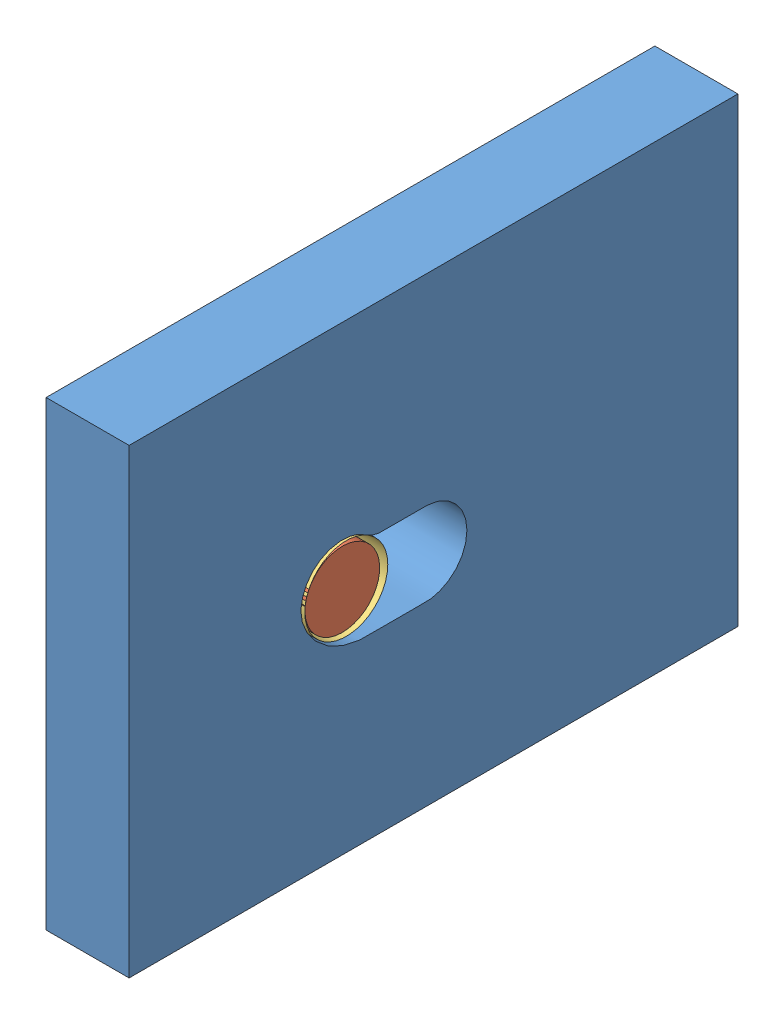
SolidWorks assembly Assem1.SLDASM, configuration Standard (file format 3400). Lengths in mm.
Overall size (20 111.13 146.67).
3 component instances, 3 part files, 4 mates.
Components (placement in the parent):
- Bahn-1: Bahn.SLDPRT [Standard] at origin size (20 111.13 146.67)
- Stift-1: Stift.sldprt [Standard] at (0 2.6842 9.3542) x (1 0 0) z (0 0.566814 0.823846) size (20 18 18)
- Tangentenring-1: Tangentenring.SLDPRT [Standard] at (0 2.3831 8.4006) size (20 20 20)
Mates (geometry in assembly coordinates):
- Coincident1: coincident aligned: plane of Bahn-1 through (20 -52.727 60.7218) normal (1 0 0); plane of Stift-1 through (20 2.6842 9.3542) normal (1 0 0)
- Tangent1: tangent aligned: cylinder of Stift-1; cylinder of Tangentenring-1
- Coincident2: coincident aligned: plane of Bahn-1 through (20 -52.727 60.7218) normal (1 0 0); circle of Tangentenring-1
- Tangent2: tangent: face of Bahn-1; cylinder of Tangentenring-1
